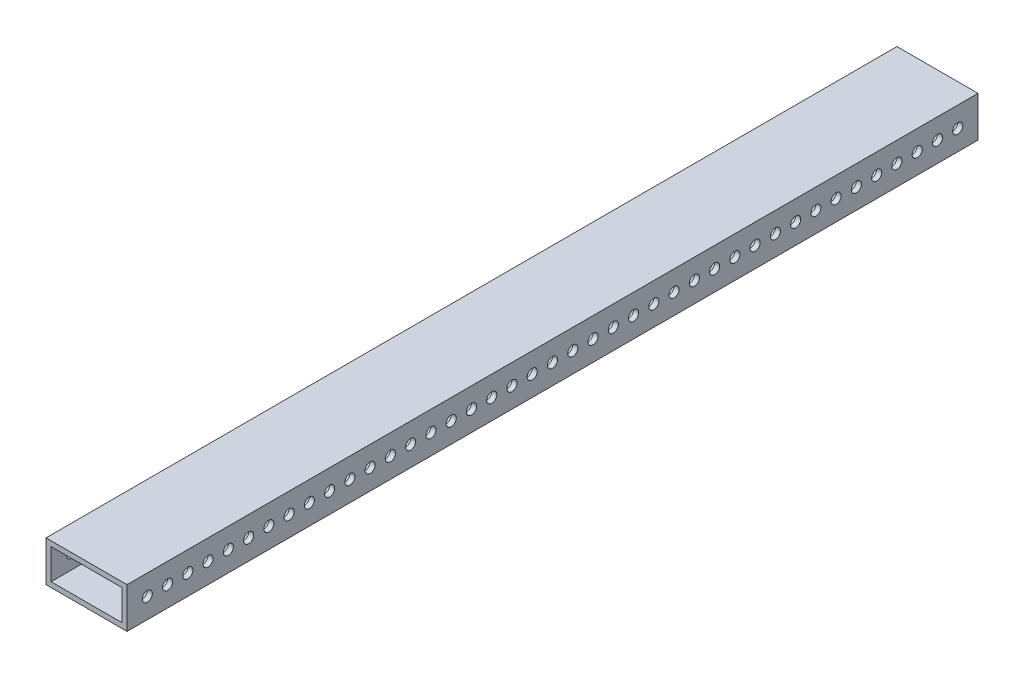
from build123d import *

# Parameters (mm, degrees)
SKETCH1_W           = 50.8
SKETCH1_H           = 25.4
SKETCH1_W_2         = 44.45
SKETCH1_H_2         = 19.05
BOSS_EXTRUDE1_DEPTH = 266.7
SKETCH2_R           = 3.175
CUT_EXTRUDE1_DEPTH  = 272.7918689
LPATTERN1_COUNT     = 41
LPATTERN1_PITCH     = 12.7


with BuildPart() as part:
    # Sketch1 → Boss-Extrude1 (new, symmetric)
    with BuildSketch(Plane.XY):
        Rectangle(SKETCH1_W, SKETCH1_H)
        Rectangle(SKETCH1_W_2, SKETCH1_H_2, mode=Mode.SUBTRACT)
    extrude(amount=BOSS_EXTRUDE1_DEPTH, both=True)

    # Sketch2 → Cut-Extrude1 (cut, through all)
    with BuildSketch(Plane(origin=(25.4, 0, 0), x_dir=(0, 0, -1), z_dir=(1, 0, 0))):
        with Locations((-254, 0)):
            Circle(SKETCH2_R)
    cut_extrude1 = extrude(amount=-CUT_EXTRUDE1_DEPTH, mode=Mode.SUBTRACT)

    # LPattern1: Cut-Extrude1 ×41
    with Locations(*[(0, 0, -i * LPATTERN1_PITCH) for i in range(1, LPATTERN1_COUNT)]):
        add(cut_extrude1, mode=Mode.SUBTRACT)


solid = part.part
